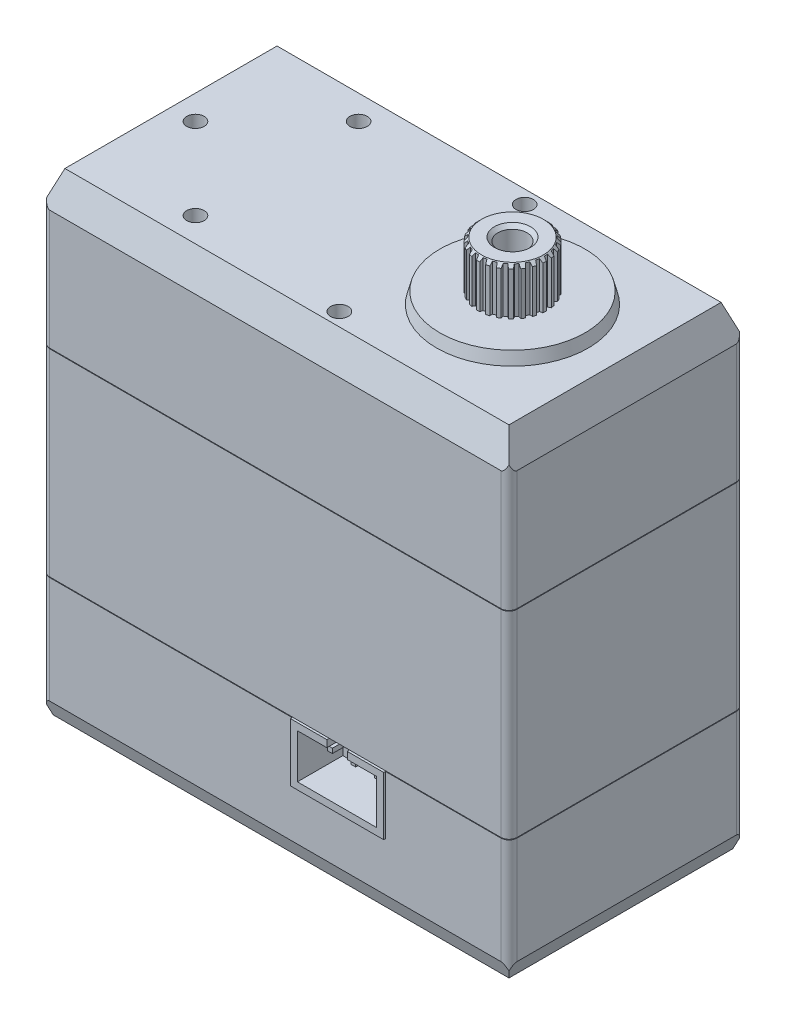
from build123d import *

# Parameters (mm, degrees)
SKETCH1_W           = 40.1
SKETCH1_H           = 20.2
BOSS_EXTRUDE1_DEPTH = 40.6
SKETCH2_R           = 6.5
BOSS_EXTRUDE2_DEPTH = 1.5
BOSS_EXTRUDE2_TAPER = 15
BOSS_EXTRUDE3_START = -40.6
SKETCH2_2_R         = 6.5
BOSS_EXTRUDE3_DEPTH = 1
BOSS_EXTRUDE3_DRAFT = -15
SKETCH3_R           = 2.95
BOSS_EXTRUDE4_DEPTH = 4
CHAMFER1_SIZE       = 0.3
CUT_EXTRUDE1_START  = -4
CUT_EXTRUDE1_DEPTH  = 4
SKETCH5_R           = 1.25
CUT_EXTRUDE2_DEPTH  = 5
CHAMFER2_SIZE       = 0.3
SKETCH6_R           = 3
SKETCH6_R_2         = 1.2
BOSS_EXTRUDE5_DEPTH = 4.4
CHAMFER3_SIZE       = 0.3
SKETCH7_R           = 0.75
CUT_EXTRUDE3_DEPTH  = 5
SKETCH8_R           = 0.75
CUT_EXTRUDE4_DEPTH  = 5
CUT_EXTRUDE5_START  = -13
SKETCH9_W           = 40.1
SKETCH9_H           = 20.2
SKETCH9_W_2         = 40
SKETCH9_H_2         = 20.1
CUT_EXTRUDE5_DEPTH  = 0.05
CUT_EXTRUDE6_START  = -30
SKETCH9_2_W         = 40.1
SKETCH9_2_H         = 20.2
SKETCH9_2_W_2       = 40
SKETCH9_2_H_2       = 20.1
CUT_EXTRUDE6_DEPTH  = 0.05
CHAMFER4_SIZE       = 1
CHAMFER4_SIZE2      = 2.747477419
CHAMFER5_SIZE       = 0.5
CHAMFER5_SIZE2      = 1.37373871
SKETCH10_W          = 8
SKETCH10_H          = 5
SKETCH10_W_2        = 6.8
SKETCH10_H_2        = 3.8
BOSS_EXTRUDE6_DEPTH = 0.15
SKETCH11_W          = 6.8
SKETCH11_H          = 3.8
CUT_EXTRUDE7_DEPTH  = 3.75
SKETCH12_W          = 1.75
SKETCH12_H          = 0.6
CUT_EXTRUDE8_DEPTH  = 3.9
SKETCH13_W          = 0.4
SKETCH13_H          = 0.4
BOSS_EXTRUDE7_DEPTH = 2.5
FILLET1_R           = 0.7
FILLET2_R           = 0.7
SKETCH15_R          = 3.5
SKETCH15_R_2        = 3
BOSS_EXTRUDE8_DEPTH = 0.15


with BuildPart() as part:
    # Sketch1 → Boss-Extrude1 (new body)
    with BuildSketch(Plane(origin=(0, 0, 0), x_dir=(1, 0, 0), z_dir=(0, 1, 0))):
        with Locations((-10.25, 0)):
            Rectangle(SKETCH1_W, SKETCH1_H)
    extrude(amount=BOSS_EXTRUDE1_DEPTH)

    # Sketch2 → Boss-Extrude2 (add)
    with BuildSketch(Plane.XZ):
        Circle(SKETCH2_R)
    extrude(amount=BOSS_EXTRUDE2_DEPTH, taper=BOSS_EXTRUDE2_TAPER)


with BuildPart() as boss_extrude3_tool:
    # Sketch2_2 → Boss-Extrude3 (with draft: the straight prism first)
    with BuildSketch(Plane.XZ.offset(BOSS_EXTRUDE3_START)):
        Circle(SKETCH2_2_R)
    extrude(amount=-BOSS_EXTRUDE3_DEPTH)
    # Boss-Extrude3: the draft: its side faces are tilted about the plane it starts from
    boss_extrude3_sides = [boss_extrude3_tool.faces().sort_by_distance(p)[0] for p in [
        (-6.5, 41.1, 0),
    ]]
    draft(boss_extrude3_sides, Plane.XZ.offset(BOSS_EXTRUDE3_START), BOSS_EXTRUDE3_DRAFT)


with BuildPart() as part_1:
    add(part.part)

    # Boss-Extrude3: add boss_extrude3_tool
    add(boss_extrude3_tool.part)

    # Sketch3 → Boss-Extrude4 (add)
    with BuildSketch(Plane(origin=(0, 41.6, 0), x_dir=(1, 0, 0), z_dir=(0, 1, 0))):
        with Locations(Location((0, 0, 0), (0, 0, 270))):
            Circle(SKETCH3_R)
    extrude(amount=BOSS_EXTRUDE4_DEPTH)

    # Chamfer1
    chamfer1_edges = [part_1.edges().sort_by_distance(p)[0] for p in [
        (0, 45.6, -2.95),
    ]]
    chamfer(chamfer1_edges, length=CHAMFER1_SIZE)

    # Sketch4 → Cut-Extrude1 (cut)
    with BuildSketch(Plane(origin=(0, 45.6, 0), x_dir=(1, 0, 0), z_dir=(0, 1, 0)).offset(CUT_EXTRUDE1_START)):
        with BuildLine():
            Line((-0.226820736, 2.941267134), (-0.14402343, 2.713783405))
            Line((-0.14402343, 2.713783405), (0.14402343, 2.713783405))
            Line((0.14402343, 2.713783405), (0.226820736, 2.941267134))
            ThreePointArc((0.226820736, 2.941267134), (0, 2.95), (-0.226820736, 2.941267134))
        make_face()
        with BuildLine():
            Line((0.511768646, 2.905269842), (0.53539182, 2.66434208))
            Line((0.53539182, 2.66434208), (0.814389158, 2.592707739))
            Line((0.814389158, 2.592707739), (0.951158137, 2.792453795))
            ThreePointArc((0.951158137, 2.792453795), (0.733635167, 2.857320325), (0.511768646, 2.905269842))
        make_face()
        with BuildLine():
            Line((1.218201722, 2.68672376), (1.181166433, 2.447490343))
            Line((1.181166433, 2.447490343), (1.43358382, 2.30872271))
            Line((1.43358382, 2.30872271), (1.615730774, 2.468180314))
            ThreePointArc((1.615730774, 2.468180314), (1.421173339, 2.585104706), (1.218201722, 2.68672376))
        make_face()
        with BuildLine():
            Line((1.848090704, 2.299360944), (1.752724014, 2.076853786))
            Line((1.752724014, 2.076853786), (1.962701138, 1.879672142))
            Line((1.962701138, 1.879672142), (2.178781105, 1.988821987))
            ThreePointArc((2.178781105, 1.988821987), (2.019413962, 2.150457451), (1.848090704, 2.299360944))
        make_face()
        with BuildLine():
            Line((2.36185735, 1.767520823), (2.2141515, 1.575720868))
            Line((2.2141515, 1.575720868), (2.368494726, 1.332514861))
            Line((2.368494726, 1.332514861), (2.604930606, 1.38449866))
            ThreePointArc((2.604930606, 1.38449866), (2.49076738, 1.580689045), (2.36185735, 1.767520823))
        make_face()
        with BuildLine():
            Line((2.727219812, 1.124620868), (2.536455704, 0.975579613))
            Line((2.536455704, 0.975579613), (2.625467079, 0.70163077))
            Line((2.625467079, 0.70163077), (2.867402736, 0.693182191))
            ThreePointArc((2.867402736, 0.693182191), (2.805616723, 0.911600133), (2.727219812, 1.124620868))
        make_face()
        with BuildLine():
            Line((2.921221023, 0.411056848), (2.699385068, 0.314139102))
            Line((2.699385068, 0.314139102), (2.71747168, 0.026660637))
            Line((2.71747168, 0.026660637), (2.949705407, -0.041689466))
            ThreePointArc((2.949705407, -0.041689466), (2.944178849, 0.185232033), (2.921221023, 0.411056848))
        make_face()
        with BuildLine():
            Line((2.931671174, -0.328335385), (2.69270214, -0.367039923))
            Line((2.69270214, -0.367039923), (2.638727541, -0.649984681))
            Line((2.638727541, -0.649984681), (2.846667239, -0.773941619))
            ThreePointArc((2.846667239, -0.773941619), (2.89774739, -0.552774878), (2.931671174, -0.328335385))
        make_face()
        with BuildLine():
            Line((2.757913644, -1.047097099), (2.516826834, -1.02515648))
            Line((2.516826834, -1.02515648), (2.394182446, -1.285789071))
            Line((2.394182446, -1.285789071), (2.564762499, -1.457564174))
            ThreePointArc((2.564762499, -1.457564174), (2.669239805, -1.25604891), (2.757913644, -1.047097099))
        make_face()
        with BuildLine():
            Line((2.410866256, -1.700065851), (2.182810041, -1.618858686))
            Line((2.182810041, -1.618858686), (1.999202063, -1.840802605))
            Line((1.999202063, -1.840802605), (2.121704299, -2.049602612))
            ThreePointArc((2.121704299, -2.049602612), (2.273014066, -1.88040077), (2.410866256, -1.700065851))
        make_face()
        with BuildLine():
            Line((1.912335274, -2.246213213), (1.711639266, -2.110842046))
            Line((1.711639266, -2.110842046), (1.478604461, -2.280151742))
            Line((1.478604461, -2.280151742), (1.545331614, -2.51285698))
            ThreePointArc((1.545331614, -2.51285698), (1.733966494, -2.386600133), (1.912335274, -2.246213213))
        make_face()
        with BuildLine():
            Line((1.293645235, -2.651222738), (1.132919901, -2.470193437))
            Line((1.132919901, -2.470193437), (0.865100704, -2.576230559))
            Line((0.865100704, -2.576230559), (0.871860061, -2.818219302))
            ThreePointArc((0.871860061, -2.818219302), (1.08596743, -2.742840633), (1.293645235, -2.651222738))
        make_face()
        with BuildLine():
            Line((0.593670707, -2.889646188), (0.483015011, -2.67433349))
            Line((0.483015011, -2.67433349), (0.197239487, -2.710435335))
            Line((0.197239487, -2.710435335), (0.143606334, -2.94650254))
            ThreePointArc((0.143606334, -2.94650254), (0.369733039, -2.926738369), (0.593670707, -2.889646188))
        make_face()
        with BuildLine():
            Line((-0.143606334, -2.94650254), (-0.197239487, -2.710435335))
            Line((-0.197239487, -2.710435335), (-0.483015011, -2.67433349))
            Line((-0.483015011, -2.67433349), (-0.593670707, -2.889646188))
            ThreePointArc((-0.593670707, -2.889646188), (-0.369733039, -2.926738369), (-0.143606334, -2.94650254))
        make_face()
        with BuildLine():
            Line((-0.871860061, -2.818219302), (-0.865100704, -2.576230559))
            Line((-0.865100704, -2.576230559), (-1.132919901, -2.470193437))
            Line((-1.132919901, -2.470193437), (-1.293645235, -2.651222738))
            ThreePointArc((-1.293645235, -2.651222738), (-1.08596743, -2.742840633), (-0.871860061, -2.818219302))
        make_face()
        with BuildLine():
            Line((-1.545331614, -2.51285698), (-1.478604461, -2.280151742))
            Line((-1.478604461, -2.280151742), (-1.711639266, -2.110842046))
            Line((-1.711639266, -2.110842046), (-1.912335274, -2.246213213))
            ThreePointArc((-1.912335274, -2.246213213), (-1.733966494, -2.386600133), (-1.545331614, -2.51285698))
        make_face()
        with BuildLine():
            Line((-2.121704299, -2.049602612), (-1.999202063, -1.840802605))
            Line((-1.999202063, -1.840802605), (-2.182810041, -1.618858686))
            Line((-2.182810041, -1.618858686), (-2.410866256, -1.700065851))
            ThreePointArc((-2.410866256, -1.700065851), (-2.273014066, -1.88040077), (-2.121704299, -2.049602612))
        make_face()
        with BuildLine():
            Line((-2.564762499, -1.457564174), (-2.394182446, -1.285789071))
            Line((-2.394182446, -1.285789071), (-2.516826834, -1.02515648))
            Line((-2.516826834, -1.02515648), (-2.757913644, -1.047097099))
            ThreePointArc((-2.757913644, -1.047097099), (-2.669239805, -1.25604891), (-2.564762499, -1.457564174))
        make_face()
        with BuildLine():
            Line((-2.846667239, -0.773941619), (-2.638727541, -0.649984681))
            Line((-2.638727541, -0.649984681), (-2.69270214, -0.367039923))
            Line((-2.69270214, -0.367039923), (-2.931671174, -0.328335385))
            ThreePointArc((-2.931671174, -0.328335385), (-2.89774739, -0.552774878), (-2.846667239, -0.773941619))
        make_face()
        with BuildLine():
            Line((-2.949705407, -0.041689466), (-2.71747168, 0.026660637))
            Line((-2.71747168, 0.026660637), (-2.699385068, 0.314139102))
            Line((-2.699385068, 0.314139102), (-2.921221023, 0.411056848))
            ThreePointArc((-2.921221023, 0.411056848), (-2.944178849, 0.185232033), (-2.949705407, -0.041689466))
        make_face()
        with BuildLine():
            Line((-2.867402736, 0.693182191), (-2.625467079, 0.70163077))
            Line((-2.625467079, 0.70163077), (-2.536455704, 0.975579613))
            Line((-2.536455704, 0.975579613), (-2.727219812, 1.124620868))
            ThreePointArc((-2.727219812, 1.124620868), (-2.805616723, 0.911600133), (-2.867402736, 0.693182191))
        make_face()
        with BuildLine():
            Line((-2.604930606, 1.38449866), (-2.368494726, 1.332514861))
            Line((-2.368494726, 1.332514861), (-2.2141515, 1.575720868))
            Line((-2.2141515, 1.575720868), (-2.36185735, 1.767520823))
            ThreePointArc((-2.36185735, 1.767520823), (-2.49076738, 1.580689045), (-2.604930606, 1.38449866))
        make_face()
        with BuildLine():
            Line((-2.178781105, 1.988821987), (-1.962701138, 1.879672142))
            Line((-1.962701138, 1.879672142), (-1.752724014, 2.076853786))
            Line((-1.752724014, 2.076853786), (-1.848090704, 2.299360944))
            ThreePointArc((-1.848090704, 2.299360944), (-2.019413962, 2.150457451), (-2.178781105, 1.988821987))
        make_face()
        with BuildLine():
            Line((-1.615730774, 2.468180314), (-1.43358382, 2.30872271))
            Line((-1.43358382, 2.30872271), (-1.181166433, 2.447490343))
            Line((-1.181166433, 2.447490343), (-1.218201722, 2.68672376))
            ThreePointArc((-1.218201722, 2.68672376), (-1.421173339, 2.585104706), (-1.615730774, 2.468180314))
        make_face()
        with BuildLine():
            Line((-0.951158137, 2.792453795), (-0.814389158, 2.592707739))
            Line((-0.814389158, 2.592707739), (-0.53539182, 2.66434208))
            Line((-0.53539182, 2.66434208), (-0.511768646, 2.905269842))
            ThreePointArc((-0.511768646, 2.905269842), (-0.733635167, 2.857320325), (-0.951158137, 2.792453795))
        make_face()
    extrude(amount=CUT_EXTRUDE1_DEPTH, mode=Mode.SUBTRACT)

    # Sketch5 → Cut-Extrude2 (cut)
    with BuildSketch(Plane(origin=(0, 45.6, 0), x_dir=(1, 0, 0), z_dir=(0, 1, 0))):
        with Locations(Location((0, 0, 0), (0, 0, 270))):
            Circle(SKETCH5_R)
    extrude(amount=-CUT_EXTRUDE2_DEPTH, mode=Mode.SUBTRACT)

    # Chamfer2
    chamfer2_edges = [part_1.edges().sort_by_distance(p)[0] for p in [
        (0, 45.6, -1.25),
    ]]
    chamfer(chamfer2_edges, length=CHAMFER2_SIZE)

    # Sketch6 → Boss-Extrude5 (add)
    with BuildSketch(Plane.XZ.offset(1.5)):
        with Locations(Location((0, 0, 0), (0, 0, 270))):
            Circle(SKETCH6_R)
        with Locations(Location((0, 0, 0), (0, 0, 270))):
            Circle(SKETCH6_R_2, mode=Mode.SUBTRACT)
    extrude(amount=BOSS_EXTRUDE5_DEPTH)

    # Chamfer3
    chamfer3_edges = [part_1.edges().sort_by_distance(p)[0] for p in [
        (0, -5.9, 3),
    ]]
    chamfer(chamfer3_edges, length=CHAMFER3_SIZE)

    # Sketch7 → Cut-Extrude3 (cut)
    with BuildSketch(Plane(origin=(0, 40.6, 0), x_dir=(1, 0, 0), z_dir=(0, 1, 0))):
        with Locations(Location((-20.2, 7, 0), (0, 0, 270))):
            Circle(SKETCH7_R)
        with Locations(Location((-6.9, 7.95, 0), (0, 0, 270))):
            Circle(SKETCH7_R)
        with Locations(Location((-6.9, -7.95, 0), (0, 0, 270))):
            Circle(SKETCH7_R)
        with Locations(Location((-20.2, -7, 0), (0, 0, 270))):
            Circle(SKETCH7_R)
        with Locations(Location((-27.2, 0, 0), (0, 0, 270))):
            Circle(SKETCH7_R)
    extrude(amount=-CUT_EXTRUDE3_DEPTH, mode=Mode.SUBTRACT)

    # Sketch8 → Cut-Extrude4 (cut)
    with BuildSketch(Plane.XZ):
        with Locations(Location((-27.85, 7.6, 0), (0, 0, 270))):
            Circle(SKETCH8_R)
        with Locations(Location((-12.75, 7.6, 0), (0, 0, 270))):
            Circle(SKETCH8_R)
        with Locations(Location((7.35, 7.6, 0), (0, 0, 270))):
            Circle(SKETCH8_R)
        with Locations(Location((7.35, -7.6, 0), (0, 0, 270))):
            Circle(SKETCH8_R)
        with Locations(Location((-12.75, -7.6, 0), (0, 0, 270))):
            Circle(SKETCH8_R)
        with Locations(Location((-27.85, -7.6, 0), (0, 0, 270))):
            Circle(SKETCH8_R)
    extrude(amount=-CUT_EXTRUDE4_DEPTH, mode=Mode.SUBTRACT)

    # Sketch9 → Cut-Extrude5 (cut)
    with BuildSketch(Plane(origin=(0, 40.6, 0), x_dir=(1, 0, 0), z_dir=(0, 1, 0)).offset(CUT_EXTRUDE5_START)):
        with Locations((-10.25, 0)):
            Rectangle(SKETCH9_W, SKETCH9_H)
        with Locations((-10.25, 0)):
            Rectangle(SKETCH9_W_2, SKETCH9_H_2, mode=Mode.SUBTRACT)
    extrude(amount=-CUT_EXTRUDE5_DEPTH, mode=Mode.SUBTRACT)

    # Sketch9_2 → Cut-Extrude6 (cut)
    with BuildSketch(Plane(origin=(0, 40.6, 0), x_dir=(1, 0, 0), z_dir=(0, 1, 0)).offset(CUT_EXTRUDE6_START)):
        with Locations((-10.25, 0)):
            Rectangle(SKETCH9_2_W, SKETCH9_2_H)
        with Locations((-10.25, 0)):
            Rectangle(SKETCH9_2_W_2, SKETCH9_2_H_2, mode=Mode.SUBTRACT)
    extrude(amount=-CUT_EXTRUDE6_DEPTH, mode=Mode.SUBTRACT)

    # Chamfer4
    chamfer4_edges = [part_1.edges().sort_by_distance(p)[0] for p in [
        (9.8, 40.6, 0),
        (-10.25, 40.6, -10.1),
        (-30.3, 40.6, 0),
        (-10.25, 40.6, 10.1),
    ]]
    chamfer4_side = [part_1.faces().sort_by_distance(p)[0] for p in [
        (-12.205602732, 40.6, 0),
    ]]
    chamfer(chamfer4_edges, length=CHAMFER4_SIZE, length2=CHAMFER4_SIZE2, reference=chamfer4_side[0])

    # Chamfer5
    chamfer5_edges = [part_1.edges().sort_by_distance(p)[0] for p in [
        (-10.25, 0, -10.1),
        (9.8, 0, 0),
        (-10.25, 0, 10.1),
        (-30.3, 0, 0),
    ]]
    chamfer5_side = [part_1.faces().sort_by_distance(p)[0] for p in [
        (-12.277450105, 0, 0),
    ]]
    chamfer(chamfer5_edges, length=CHAMFER5_SIZE, length2=CHAMFER5_SIZE2, reference=chamfer5_side[0])

    # Sketch10 → Boss-Extrude6 (add)
    with BuildSketch(Plane.XY.offset(10.1)):
        with Locations((-4.8, 8.05)):
            Rectangle(SKETCH10_W, SKETCH10_H)
        with Locations((-4.8, 8.05)):
            Rectangle(SKETCH10_W_2, SKETCH10_H_2, mode=Mode.SUBTRACT)
    boss_extrude6 = extrude(amount=BOSS_EXTRUDE6_DEPTH)

    # Sketch11 → Cut-Extrude7 (cut)
    with BuildSketch(Plane.XY.offset(10.1)):
        with Locations((-4.8, 8.05)):
            Rectangle(SKETCH11_W, SKETCH11_H)
    cut_extrude7 = extrude(amount=-CUT_EXTRUDE7_DEPTH, mode=Mode.SUBTRACT)

    # Sketch12 → Cut-Extrude8 (cut)
    with BuildSketch(Plane.XY.offset(10.25)):
        with Locations((-4.8, 10.25)):
            Rectangle(SKETCH12_W, SKETCH12_H)
    cut_extrude8 = extrude(amount=-CUT_EXTRUDE8_DEPTH, mode=Mode.SUBTRACT)

    # Sketch13 → Boss-Extrude7 (add)
    with BuildSketch(Plane.XY.offset(6.35)):
        with Locations((-6.8, 8.55)):
            Rectangle(SKETCH13_W, SKETCH13_H)
        with Locations((-4.8, 8.55)):
            Rectangle(SKETCH13_W, SKETCH13_H)
        with Locations((-2.8, 8.55)):
            Rectangle(SKETCH13_W, SKETCH13_H)
    boss_extrude7 = extrude(amount=BOSS_EXTRUDE7_DEPTH)

    # Mirror1: Boss-Extrude6, Cut-Extrude7, Cut-Extrude8, Boss-Extrude7 across plane
    add(boss_extrude6.mirror(Plane.XY))
    add(cut_extrude7.mirror(Plane.XY), mode=Mode.SUBTRACT)
    add(cut_extrude8.mirror(Plane.XY), mode=Mode.SUBTRACT)
    add(boss_extrude7.mirror(Plane.XY))

    # Fillet1
    fillet1_edges = [part_1.edges().sort_by_distance(p)[0] for p in [
        (-30.3, 19.075, -10.1),
        (9.8, 19.075, -10.1),
        (9.8, 19.075, 10.1),
        (-30.3, 19.075, 10.1),
        (9.75, 27.575, -10.05),
        (9.75, 27.575, 10.05),
        (-30.25, 27.575, 10.05),
        (-30.25, 27.575, -10.05),
        (9.75, 10.575, -10.05),
        (9.75, 10.575, 10.05),
        (-30.25, 10.575, 10.05),
        (-30.25, 10.575, -10.05),
    ]]
    fillet(fillet1_edges, radius=FILLET1_R)

    # Fillet2
    fillet2_edges = [part_1.edges().sort_by_distance(p)[0] for p in [
        (-30.3, 5.961869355, -10.1),
        (-30.3, 5.961869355, 10.1),
        (9.8, 5.961869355, 10.1),
        (9.8, 5.961869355, -10.1),
        (9.8, 32.72626129, 10.1),
        (9.8, 32.72626129, -10.1),
        (-30.3, 32.72626129, -10.1),
        (-30.3, 32.72626129, 10.1),
    ]]
    fillet(fillet2_edges, radius=FILLET2_R)

    # Sketch15 → Boss-Extrude8 (add)
    with BuildSketch(Plane.XZ.offset(1.5)):
        with Locations(Location((0, 0, 0), (0, 0, 270))):
            Circle(SKETCH15_R)
        with Locations(Location((0, 0, 0), (0, 0, 270))):
            Circle(SKETCH15_R_2, mode=Mode.SUBTRACT)
    extrude(amount=BOSS_EXTRUDE8_DEPTH)


solid = part_1.part
